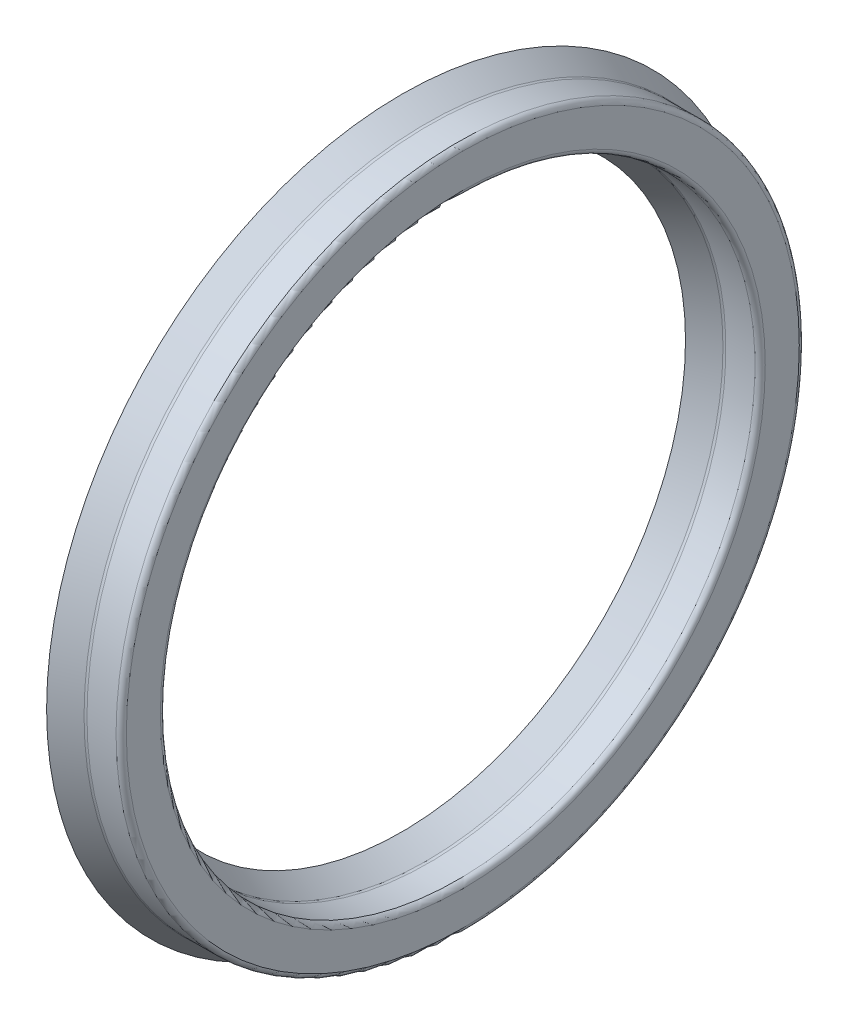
from build123d import *


with BuildPart() as part:
    # Sketch3 → Revolve1 (revolve)
    with BuildSketch(Plane.XY, mode=Mode.PRIVATE) as revolve1_sk:
        with BuildLine():
            Line((-1.734438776, 23.8125), (-0.079537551, 22.955743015))
            ThreePointArc((-0.079537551, 22.955743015), (-0.002608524, 22.926937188), (0.078951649, 22.91715))
            Line((0.078951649, 22.91715), (2.0301712, 22.91715))
            ThreePointArc((2.0301712, 22.91715), (2.273931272, 22.816181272), (2.3749, 22.5724212))
            Line((2.3749, 22.5724212), (2.3749, 20.2900788))
            ThreePointArc((2.3749, 20.2900788), (2.273931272, 20.046318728), (2.0301712, 19.94535))
            Line((2.0301712, 19.94535), (0.078951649, 19.94535))
            ThreePointArc((0.078951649, 19.94535), (-0.002608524, 19.935562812), (-0.079537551, 19.906756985))
            Line((-0.079537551, 19.906756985), (-1.734438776, 19.05))
            Line((-1.734438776, 19.05), (-2.3749, 20.287107))
            Line((-2.3749, 20.287107), (-0.756215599, 21.125114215))
            ThreePointArc((-0.756215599, 21.125114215), (-0.569976, 21.43125), (-0.756215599, 21.737385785))
            Line((-0.756215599, 21.737385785), (-2.3749, 22.575393))
            Line((-2.3749, 22.575393), (-1.734438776, 23.8125))
        make_face()
    revolve(revolve1_sk.sketch.rotate(Axis((-2.3749, 0, 0), (1, 0, 0)), 90), axis=Axis((-2.3749, 0, 0), (1, 0, 0)))


solid = part.part
